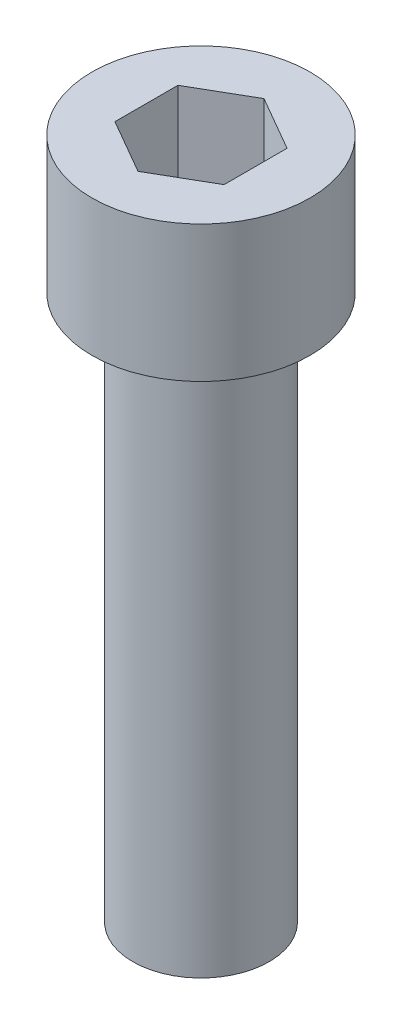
ISO-10303-21;
HEADER;
FILE_DESCRIPTION(('STEP AP214'),'2;1');
FILE_NAME('part.step','',(''),(''),'','','');
FILE_SCHEMA(('AUTOMOTIVE_DESIGN { 1 0 10303 214 1 1 1 1 }'));
ENDSEC;
DATA;
#1=APPLICATION_CONTEXT('core data for automotive mechanical design processes');
#2=APPLICATION_PROTOCOL_DEFINITION('international standard','automotive_design',2000,#1);
#3=PRODUCT_CONTEXT('',#1,'mechanical');
#4=PRODUCT('Part','Part','',(#3));
#5=PRODUCT_RELATED_PRODUCT_CATEGORY('part','',(#4));
#6=PRODUCT_DEFINITION_FORMATION('','',#4);
#7=PRODUCT_DEFINITION_CONTEXT('part definition',#1,'design');
#8=PRODUCT_DEFINITION('design','',#6,#7);
#9=PRODUCT_DEFINITION_SHAPE('','',#8);
#10=(LENGTH_UNIT() NAMED_UNIT(*) SI_UNIT(.MILLI.,.METRE.));
#11=(NAMED_UNIT(*) PLANE_ANGLE_UNIT() SI_UNIT($,.RADIAN.));
#12=(NAMED_UNIT(*) SI_UNIT($,.STERADIAN.) SOLID_ANGLE_UNIT());
#13=UNCERTAINTY_MEASURE_WITH_UNIT(LENGTH_MEASURE(1.E-05),#10,'distance_accuracy_value','');
#14=(GEOMETRIC_REPRESENTATION_CONTEXT(3) GLOBAL_UNCERTAINTY_ASSIGNED_CONTEXT((#13)) GLOBAL_UNIT_ASSIGNED_CONTEXT((#10,
#11,#12)) REPRESENTATION_CONTEXT('',''));
#15=CARTESIAN_POINT('',(0.,0.,0.));
#16=DIRECTION('',(0.,0.,1.));
#17=DIRECTION('',(1.,0.,0.));
#18=AXIS2_PLACEMENT_3D('',#15,#16,#17);
#19=CARTESIAN_POINT('',(0.,-40.,0.));
#20=DIRECTION('',(0.,1.,0.));
#21=DIRECTION('',(0.,0.,1.));
#22=AXIS2_PLACEMENT_3D('',#19,#20,#21);
#23=PLANE('',#22);
#24=CARTESIAN_POINT('',(0.,-40.,0.));
#25=DIRECTION('',(0.,1.,0.));
#26=DIRECTION('',(0.,0.,1.));
#27=AXIS2_PLACEMENT_3D('',#24,#25,#26);
#28=CIRCLE('',#27,5.);
#29=CARTESIAN_POINT('',(0.,-40.,5.));
#30=VERTEX_POINT('',#29);
#31=EDGE_CURVE('E10',#30,#30,#28,.T.);
#32=ORIENTED_EDGE('',*,*,#31,.F.);
#33=EDGE_LOOP('',(#32));
#34=FACE_BOUND('',#33,.T.);
#35=ADVANCED_FACE('F16',(#34),#23,.F.);
#36=CARTESIAN_POINT('',(0.,0.,0.));
#37=DIRECTION('',(0.,1.,0.));
#38=DIRECTION('',(0.,0.,1.));
#39=AXIS2_PLACEMENT_3D('',#36,#37,#38);
#40=CYLINDRICAL_SURFACE('',#39,5.);
#41=CARTESIAN_POINT('',(0.,0.,0.));
#42=DIRECTION('',(0.,1.,0.));
#43=DIRECTION('',(0.,0.,1.));
#44=AXIS2_PLACEMENT_3D('',#41,#42,#43);
#45=CIRCLE('',#44,5.);
#46=CARTESIAN_POINT('',(0.,0.,5.));
#47=VERTEX_POINT('',#46);
#48=EDGE_CURVE('E111',#47,#47,#45,.F.);
#49=ORIENTED_EDGE('',*,*,#48,.T.);
#50=EDGE_LOOP('',(#49));
#51=FACE_BOUND('',#50,.T.);
#52=ORIENTED_EDGE('',*,*,#31,.T.);
#53=EDGE_LOOP('',(#52));
#54=FACE_BOUND('',#53,.T.);
#55=ADVANCED_FACE('F18',(#51,#54),#40,.T.);
#56=CARTESIAN_POINT('',(4.,2.9,-6.92820323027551));
#57=DIRECTION('',(0.,-1.,0.));
#58=DIRECTION('',(0.,0.,-1.));
#59=AXIS2_PLACEMENT_3D('',#56,#57,#58);
#60=PLANE('',#59);
#61=DIRECTION('',(0.,0.,1.));
#62=VECTOR('',#61,1.);
#63=CARTESIAN_POINT('',(-4.,2.9,-2.30940107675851));
#64=LINE('',#63,#62);
#65=CARTESIAN_POINT('',(-4.,2.9,-2.30940107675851));
#66=VERTEX_POINT('',#65);
#67=CARTESIAN_POINT('',(-4.,2.9,2.30940107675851));
#68=VERTEX_POINT('',#67);
#69=EDGE_CURVE('E108',#66,#68,#64,.T.);
#70=ORIENTED_EDGE('',*,*,#69,.T.);
#71=DIRECTION('',(0.866025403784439,0.,0.5));
#72=VECTOR('',#71,1.);
#73=CARTESIAN_POINT('',(-4.,2.9,2.30940107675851));
#74=LINE('',#73,#72);
#75=CARTESIAN_POINT('',(0.,2.9,4.61880215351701));
#76=VERTEX_POINT('',#75);
#77=EDGE_CURVE('E102',#68,#76,#74,.T.);
#78=ORIENTED_EDGE('',*,*,#77,.T.);
#79=DIRECTION('',(-0.866025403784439,0.,0.5));
#80=VECTOR('',#79,1.);
#81=CARTESIAN_POINT('',(4.,2.9,2.30940107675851));
#82=LINE('',#81,#80);
#83=CARTESIAN_POINT('',(4.,2.9,2.30940107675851));
#84=VERTEX_POINT('',#83);
#85=EDGE_CURVE('E100',#84,#76,#82,.T.);
#86=ORIENTED_EDGE('',*,*,#85,.F.);
#87=DIRECTION('',(0.,0.,1.));
#88=VECTOR('',#87,1.);
#89=CARTESIAN_POINT('',(4.,2.9,-2.30940107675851));
#90=LINE('',#89,#88);
#91=CARTESIAN_POINT('',(4.,2.9,-2.30940107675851));
#92=VERTEX_POINT('',#91);
#93=EDGE_CURVE('E73',#92,#84,#90,.T.);
#94=ORIENTED_EDGE('',*,*,#93,.F.);
#95=DIRECTION('',(-0.866025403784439,0.,-0.5));
#96=VECTOR('',#95,1.);
#97=CARTESIAN_POINT('',(4.,2.9,-2.30940107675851));
#98=LINE('',#97,#96);
#99=CARTESIAN_POINT('',(0.,2.9,-4.61880215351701));
#100=VERTEX_POINT('',#99);
#101=EDGE_CURVE('E94',#92,#100,#98,.T.);
#102=ORIENTED_EDGE('',*,*,#101,.T.);
#103=DIRECTION('',(0.866025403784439,0.,-0.5));
#104=VECTOR('',#103,1.);
#105=CARTESIAN_POINT('',(-4.,2.9,-2.30940107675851));
#106=LINE('',#105,#104);
#107=EDGE_CURVE('E88',#66,#100,#106,.T.);
#108=ORIENTED_EDGE('',*,*,#107,.F.);
#109=EDGE_LOOP('',(#70,#78,#86,#94,#102,#108));
#110=FACE_BOUND('',#109,.T.);
#111=ADVANCED_FACE('F141',(#110),#60,.F.);
#112=CARTESIAN_POINT('',(-4.,2.9,-2.30940107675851));
#113=DIRECTION('',(0.5,0.,0.866025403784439));
#114=DIRECTION('',(0.866025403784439,0.,-0.5));
#115=AXIS2_PLACEMENT_3D('',#112,#113,#114);
#116=PLANE('',#115);
#117=ORIENTED_EDGE('',*,*,#107,.T.);
#118=DIRECTION('',(0.,1.,0.));
#119=VECTOR('',#118,1.);
#120=CARTESIAN_POINT('',(0.,2.9,-4.61880215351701));
#121=LINE('',#120,#119);
#122=CARTESIAN_POINT('',(0.,10.,-4.61880215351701));
#123=VERTEX_POINT('',#122);
#124=EDGE_CURVE('E86',#100,#123,#121,.T.);
#125=ORIENTED_EDGE('',*,*,#124,.T.);
#126=DIRECTION('',(-0.866025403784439,0.,0.5));
#127=VECTOR('',#126,1.);
#128=CARTESIAN_POINT('',(0.,10.,-4.61880215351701));
#129=LINE('',#128,#127);
#130=CARTESIAN_POINT('',(-4.,10.,-2.30940107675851));
#131=VERTEX_POINT('',#130);
#132=EDGE_CURVE('E79',#123,#131,#129,.T.);
#133=ORIENTED_EDGE('',*,*,#132,.T.);
#134=DIRECTION('',(0.,1.,0.));
#135=VECTOR('',#134,1.);
#136=CARTESIAN_POINT('',(-4.,2.9,-2.30940107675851));
#137=LINE('',#136,#135);
#138=EDGE_CURVE('E91',#131,#66,#137,.F.);
#139=ORIENTED_EDGE('',*,*,#138,.T.);
#140=EDGE_LOOP('',(#117,#125,#133,#139));
#141=FACE_BOUND('',#140,.T.);
#142=ADVANCED_FACE('F149',(#141),#116,.T.);
#143=CARTESIAN_POINT('',(-4.,2.9,-2.30940107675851));
#144=DIRECTION('',(-1.,0.,0.));
#145=DIRECTION('',(0.,0.,1.));
#146=AXIS2_PLACEMENT_3D('',#143,#144,#145);
#147=PLANE('',#146);
#148=DIRECTION('',(0.,1.,0.));
#149=VECTOR('',#148,1.);
#150=CARTESIAN_POINT('',(-4.,2.9,2.30940107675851));
#151=LINE('',#150,#149);
#152=CARTESIAN_POINT('',(-4.,10.,2.30940107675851));
#153=VERTEX_POINT('',#152);
#154=EDGE_CURVE('E105',#153,#68,#151,.F.);
#155=ORIENTED_EDGE('',*,*,#154,.T.);
#156=ORIENTED_EDGE('',*,*,#69,.F.);
#157=ORIENTED_EDGE('',*,*,#138,.F.);
#158=DIRECTION('',(0.,0.,-1.));
#159=VECTOR('',#158,1.);
#160=CARTESIAN_POINT('',(-4.,10.,0.));
#161=LINE('',#160,#159);
#162=EDGE_CURVE('E84',#131,#153,#161,.F.);
#163=ORIENTED_EDGE('',*,*,#162,.T.);
#164=EDGE_LOOP('',(#155,#156,#157,#163));
#165=FACE_BOUND('',#164,.T.);
#166=ADVANCED_FACE('F162',(#165),#147,.F.);
#167=CARTESIAN_POINT('',(-4.,2.9,2.30940107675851));
#168=DIRECTION('',(-0.5,0.,0.866025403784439));
#169=DIRECTION('',(0.866025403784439,0.,0.5));
#170=AXIS2_PLACEMENT_3D('',#167,#168,#169);
#171=PLANE('',#170);
#172=DIRECTION('',(0.,1.,0.));
#173=VECTOR('',#172,1.);
#174=CARTESIAN_POINT('',(0.,2.9,4.61880215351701));
#175=LINE('',#174,#173);
#176=CARTESIAN_POINT('',(0.,10.,4.61880215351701));
#177=VERTEX_POINT('',#176);
#178=EDGE_CURVE('E62',#76,#177,#175,.T.);
#179=ORIENTED_EDGE('',*,*,#178,.F.);
#180=ORIENTED_EDGE('',*,*,#77,.F.);
#181=ORIENTED_EDGE('',*,*,#154,.F.);
#182=DIRECTION('',(0.866025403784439,0.,0.5));
#183=VECTOR('',#182,1.);
#184=CARTESIAN_POINT('',(-4.,10.,2.30940107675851));
#185=LINE('',#184,#183);
#186=EDGE_CURVE('E67',#153,#177,#185,.T.);
#187=ORIENTED_EDGE('',*,*,#186,.T.);
#188=EDGE_LOOP('',(#179,#180,#181,#187));
#189=FACE_BOUND('',#188,.T.);
#190=ADVANCED_FACE('F169',(#189),#171,.F.);
#191=CARTESIAN_POINT('',(4.,2.9,2.30940107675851));
#192=DIRECTION('',(-0.5,0.,-0.866025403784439));
#193=DIRECTION('',(-0.866025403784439,0.,0.5));
#194=AXIS2_PLACEMENT_3D('',#191,#192,#193);
#195=PLANE('',#194);
#196=ORIENTED_EDGE('',*,*,#85,.T.);
#197=ORIENTED_EDGE('',*,*,#178,.T.);
#198=DIRECTION('',(0.866025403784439,0.,-0.5));
#199=VECTOR('',#198,1.);
#200=CARTESIAN_POINT('',(0.,10.,4.61880215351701));
#201=LINE('',#200,#199);
#202=CARTESIAN_POINT('',(4.,10.,2.30940107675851));
#203=VERTEX_POINT('',#202);
#204=EDGE_CURVE('E54',#177,#203,#201,.T.);
#205=ORIENTED_EDGE('',*,*,#204,.T.);
#206=DIRECTION('',(0.,1.,0.));
#207=VECTOR('',#206,1.);
#208=CARTESIAN_POINT('',(4.,2.9,2.30940107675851));
#209=LINE('',#208,#207);
#210=EDGE_CURVE('E59',#84,#203,#209,.T.);
#211=ORIENTED_EDGE('',*,*,#210,.F.);
#212=EDGE_LOOP('',(#196,#197,#205,#211));
#213=FACE_BOUND('',#212,.T.);
#214=ADVANCED_FACE('F57',(#213),#195,.T.);
#215=CARTESIAN_POINT('',(4.,2.9,-2.30940107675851));
#216=DIRECTION('',(-1.,0.,0.));
#217=DIRECTION('',(0.,0.,1.));
#218=AXIS2_PLACEMENT_3D('',#215,#216,#217);
#219=PLANE('',#218);
#220=ORIENTED_EDGE('',*,*,#93,.T.);
#221=ORIENTED_EDGE('',*,*,#210,.T.);
#222=DIRECTION('',(0.,0.,-1.));
#223=VECTOR('',#222,1.);
#224=CARTESIAN_POINT('',(4.,10.,0.));
#225=LINE('',#224,#223);
#226=CARTESIAN_POINT('',(4.,10.,-2.30940107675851));
#227=VERTEX_POINT('',#226);
#228=EDGE_CURVE('E66',#203,#227,#225,.T.);
#229=ORIENTED_EDGE('',*,*,#228,.T.);
#230=DIRECTION('',(0.,1.,0.));
#231=VECTOR('',#230,1.);
#232=CARTESIAN_POINT('',(4.,2.9,-2.30940107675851));
#233=LINE('',#232,#231);
#234=EDGE_CURVE('E74',#227,#92,#233,.F.);
#235=ORIENTED_EDGE('',*,*,#234,.T.);
#236=EDGE_LOOP('',(#220,#221,#229,#235));
#237=FACE_BOUND('',#236,.T.);
#238=ADVANCED_FACE('F70',(#237),#219,.T.);
#239=CARTESIAN_POINT('',(4.,2.9,-2.30940107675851));
#240=DIRECTION('',(0.5,0.,-0.866025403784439));
#241=DIRECTION('',(-0.866025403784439,0.,-0.5));
#242=AXIS2_PLACEMENT_3D('',#239,#240,#241);
#243=PLANE('',#242);
#244=ORIENTED_EDGE('',*,*,#124,.F.);
#245=ORIENTED_EDGE('',*,*,#101,.F.);
#246=ORIENTED_EDGE('',*,*,#234,.F.);
#247=DIRECTION('',(-0.866025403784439,0.,-0.5));
#248=VECTOR('',#247,1.);
#249=CARTESIAN_POINT('',(4.,10.,-2.30940107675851));
#250=LINE('',#249,#248);
#251=EDGE_CURVE('E32',#227,#123,#250,.T.);
#252=ORIENTED_EDGE('',*,*,#251,.T.);
#253=EDGE_LOOP('',(#244,#245,#246,#252));
#254=FACE_BOUND('',#253,.T.);
#255=ADVANCED_FACE('F122',(#254),#243,.F.);
#256=CARTESIAN_POINT('',(7.6,10.,0.));
#257=DIRECTION('',(0.,-1.,0.));
#258=DIRECTION('',(0.,0.,-1.));
#259=AXIS2_PLACEMENT_3D('',#256,#257,#258);
#260=PLANE('',#259);
#261=CARTESIAN_POINT('',(0.,10.,0.));
#262=DIRECTION('',(0.,-1.,0.));
#263=DIRECTION('',(0.,0.,-1.));
#264=AXIS2_PLACEMENT_3D('',#261,#262,#263);
#265=CIRCLE('',#264,8.);
#266=CARTESIAN_POINT('',(0.,10.,-8.));
#267=VERTEX_POINT('',#266);
#268=EDGE_CURVE('E25',#267,#267,#265,.T.);
#269=ORIENTED_EDGE('',*,*,#268,.F.);
#270=EDGE_LOOP('',(#269));
#271=FACE_BOUND('',#270,.T.);
#272=ORIENTED_EDGE('',*,*,#251,.F.);
#273=ORIENTED_EDGE('',*,*,#228,.F.);
#274=ORIENTED_EDGE('',*,*,#204,.F.);
#275=ORIENTED_EDGE('',*,*,#186,.F.);
#276=ORIENTED_EDGE('',*,*,#162,.F.);
#277=ORIENTED_EDGE('',*,*,#132,.F.);
#278=EDGE_LOOP('',(#272,#273,#274,#275,#276,#277));
#279=FACE_BOUND('',#278,.T.);
#280=ADVANCED_FACE('F76',(#271,#279),#260,.F.);
#281=CARTESIAN_POINT('',(0.,0.,0.));
#282=DIRECTION('',(0.,1.,0.));
#283=DIRECTION('',(0.,0.,1.));
#284=AXIS2_PLACEMENT_3D('',#281,#282,#283);
#285=CYLINDRICAL_SURFACE('',#284,8.);
#286=CARTESIAN_POINT('',(0.,0.,0.));
#287=DIRECTION('',(0.,1.,0.));
#288=DIRECTION('',(0.,0.,1.));
#289=AXIS2_PLACEMENT_3D('',#286,#287,#288);
#290=CIRCLE('',#289,8.);
#291=CARTESIAN_POINT('',(0.,0.,8.));
#292=VERTEX_POINT('',#291);
#293=EDGE_CURVE('E114',#292,#292,#290,.T.);
#294=ORIENTED_EDGE('',*,*,#293,.T.);
#295=EDGE_LOOP('',(#294));
#296=FACE_BOUND('',#295,.T.);
#297=ORIENTED_EDGE('',*,*,#268,.T.);
#298=EDGE_LOOP('',(#297));
#299=FACE_BOUND('',#298,.T.);
#300=ADVANCED_FACE('F119',(#296,#299),#285,.T.);
#301=CARTESIAN_POINT('',(5.,0.,0.));
#302=DIRECTION('',(0.,1.,0.));
#303=DIRECTION('',(0.,0.,1.));
#304=AXIS2_PLACEMENT_3D('',#301,#302,#303);
#305=PLANE('',#304);
#306=ORIENTED_EDGE('',*,*,#48,.F.);
#307=EDGE_LOOP('',(#306));
#308=FACE_BOUND('',#307,.T.);
#309=ORIENTED_EDGE('',*,*,#293,.F.);
#310=EDGE_LOOP('',(#309));
#311=FACE_BOUND('',#310,.T.);
#312=ADVANCED_FACE('F130',(#308,#311),#305,.F.);
#313=CLOSED_SHELL('',(#35,#55,#111,#142,#166,#190,#214,#238,#255,#280,#300,#312));
#314=MANIFOLD_SOLID_BREP('B1',#313);
#315=ADVANCED_BREP_SHAPE_REPRESENTATION('',(#18,#314),#14);
#316=SHAPE_DEFINITION_REPRESENTATION(#9,#315);
ENDSEC;
END-ISO-10303-21;
